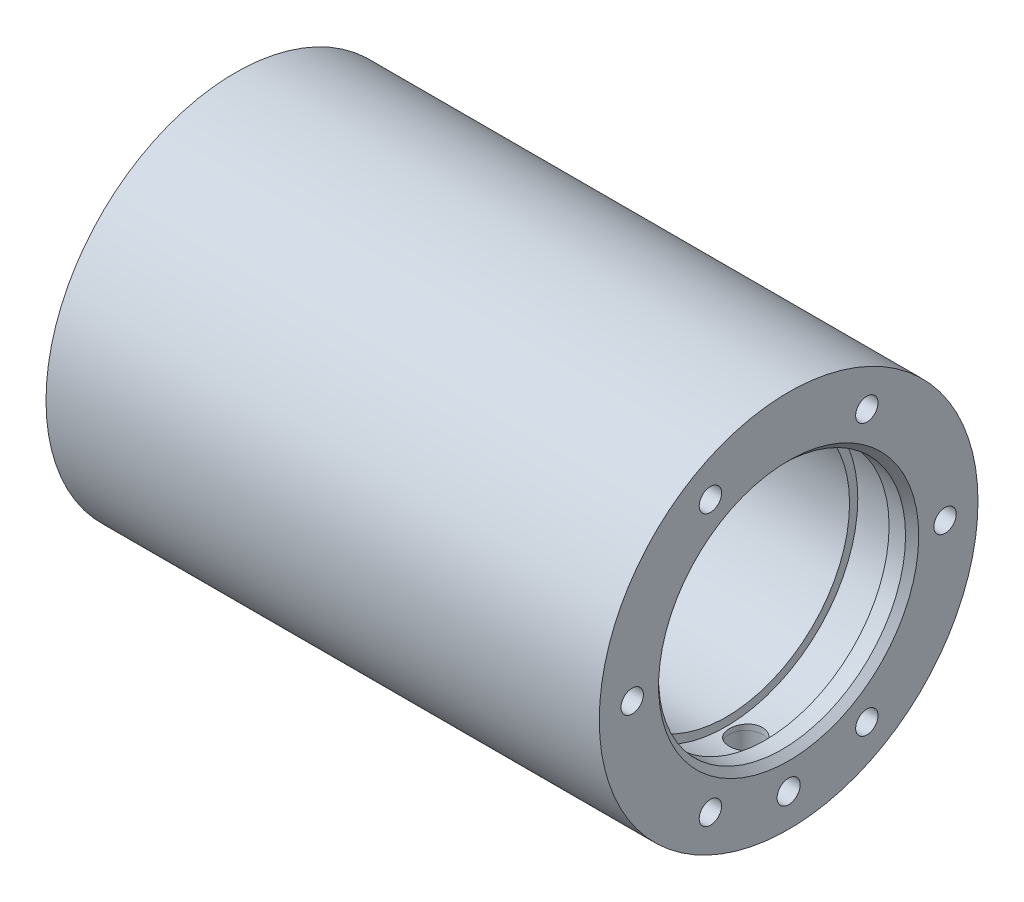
from build123d import *

# Parameters (mm, degrees)
CHAMFER_1_SIZE           = 2
SKETCH_2_R               = 3.5
CUT_EXTRUDE_2_DEPTH      = 22
CUT_EXTRUDE_5_REACH      = 188.645
SKETCH_13_R              = 3.5
PATTERN_CIRCULAR_1_COUNT = 6
PATTERN_CIRCULAR_2_COUNT = 6


with BuildPart() as part:
    # Sketch 1 → Revolve 1 (revolve)
    with BuildSketch(Plane.XY, mode=Mode.PRIVATE) as revolve_1_sk:
        Polygon((0, 37.5), (16, 37.5), (16, 40), (28, 40), (28, 37.5), (149, 37.5), (149, 40), (161, 40), (161, 37.5), (168, 37.5), (168, 57.5), (0, 57.5), align=None)
    revolve(revolve_1_sk.sketch.rotate(Axis((0, 0, 0), (-1, 0, 0)), 90), axis=Axis((0, 0, 0), (-1, 0, 0)))

    # Chamfer 1
    chamfer_1_edges = [part.edges().sort_by_distance(p)[0] for p in [
        (168, 0, 37.5),
        (0, 0, 37.5),
    ]]
    chamfer(chamfer_1_edges, length=CHAMFER_1_SIZE)

    # Sketch 2 → Cut-Extrude 2 (cut)
    with BuildSketch(Plane(origin=(0, 0, 0), x_dir=(0, 0, -1), z_dir=(1, 0, 0))):
        with Locations((0, -47.5)):
            Circle(SKETCH_2_R)
    extrude(amount=CUT_EXTRUDE_2_DEPTH, mode=Mode.SUBTRACT)

    # Sketch 4 → NPT1_4 (revolve, cut)
    with BuildSketch(Plane.XY, mode=Mode.PRIVATE) as npt1_4_sk:
        Polygon((16.5, -57.5), (17, -41.5), (17, -36.388461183), (22, -36.388461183), (22, -57.5), align=None)
    revolve(npt1_4_sk.sketch.rotate(Axis((22, -57.5, 0), (0, -1, 0)), 46.014328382), axis=Axis((22, -57.5, 0), (0, -1, 0)), mode=Mode.SUBTRACT)

    # Sketch 5 → NPT1_4_2 (revolve, cut)
    with BuildSketch(Plane.XY, mode=Mode.PRIVATE) as npt1_4_2_sk:
        Polygon((155, -32.68347642), (155, -57.5), (160.5, -57.5), (160, -41.5), (160, -32.68347642), align=None)
    revolve(npt1_4_2_sk.sketch.rotate(Axis((155, -13.918278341, 0), (0, -1, 0)), 226.014328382), axis=Axis((155, -13.918278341, 0), (0, -1, 0)), mode=Mode.SUBTRACT)

    # Sketch 13 → Cut-Extrude 5 (cut, up to next)
    with BuildSketch(Plane(origin=(168, 0, 0), x_dir=(0, 0, -1), z_dir=(1, 0, 0)), mode=Mode.PRIVATE) as cut_extrude_5_sk1:
        with Locations(Location((0, -47.5, 0), (0, 0, 318.414800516))):
            Circle(SKETCH_13_R)
    cut_extrude_5_tool1 = extrude(cut_extrude_5_sk1.sketch, amount=-CUT_EXTRUDE_5_REACH, mode=Mode.PRIVATE) & part.part
    add(cut_extrude_5_tool1.solids().sort_by_distance((168, -47.5, 0))[0], mode=Mode.SUBTRACT)

    # Sketch 18 → M8x1.25 _2 (revolve, cut)
    with BuildSketch(Plane(origin=(0, 0, -47.5), x_dir=(0, 0, 1), z_dir=(0, 1, 0))):
        Polygon((0, 0), (0, 20.042926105), (3.4, 18), (3.4, 0), align=None)
    m8x1_25_2 = revolve(axis=Axis((-6.35, 0, -47.5), (1, 0, 0)), mode=Mode.SUBTRACT)

    # Pattern Circular 1: M8x1.25 _2 ×6 about axis
    pattern_circular_1_axis = Axis((0, 0, 0), (1, 0, 0))
    for i in range(1, PATTERN_CIRCULAR_1_COUNT):
        add(m8x1_25_2.rotate(pattern_circular_1_axis, i * 360 / PATTERN_CIRCULAR_1_COUNT), mode=Mode.SUBTRACT)

    # Sketch 22 → M8x1.25 _3 (revolve, cut)
    with BuildSketch(Plane(origin=(168, 0, -47.5), x_dir=(0, 0, -1), z_dir=(0, 1, 0))):
        Polygon((0, 0), (0, 20.042926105), (3.4, 18), (3.4, 0), align=None)
    m8x1_25_3 = revolve(axis=Axis((174.35, 0, -47.5), (-1, 0, 0)), mode=Mode.SUBTRACT)

    # Pattern Circular 2: M8x1.25 _3 ×6 about axis
    pattern_circular_2_axis = Axis((0, 0, 0), (1, 0, 0))
    for i in range(1, PATTERN_CIRCULAR_2_COUNT):
        add(m8x1_25_3.rotate(pattern_circular_2_axis, i * 360 / PATTERN_CIRCULAR_2_COUNT), mode=Mode.SUBTRACT)

    # Sketch 25 → Cut-Revolve 1 (revolve, cut)
    with BuildSketch(Plane(origin=(0, 24.25, 0), x_dir=(-1, 0, 0), z_dir=(0, 1, 0)), mode=Mode.PRIVATE) as cut_revolve_1_sk:
        Polygon((0, 42.002232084), (-31.905255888, 42.002232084), (-30, 38.702232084), (0, 37.802232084), align=None)
    revolve(cut_revolve_1_sk.sketch.rotate(Axis((0, 24.25, 42.002232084), (-1, 0, 0)), 180), axis=Axis((0, 24.25, 42.002232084), (-1, 0, 0)), mode=Mode.SUBTRACT)

    # Sketch 26 → Cut-Revolve 2 (revolve, cut)
    with BuildSketch(Plane(origin=(0, -24.25, 0), x_dir=(-1, 0, 0), z_dir=(0, 1, 0)), mode=Mode.PRIVATE) as cut_revolve_2_sk:
        Polygon((0, -46.2), (-30, -45.3), (-31.905255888, -42), (0, -42), align=None)
    revolve(cut_revolve_2_sk.sketch.rotate(Axis((-8.906023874, -24.25, -42), (1, 0, 0)), 180), axis=Axis((-8.906023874, -24.25, -42), (1, 0, 0)), mode=Mode.SUBTRACT)


solid = part.part
